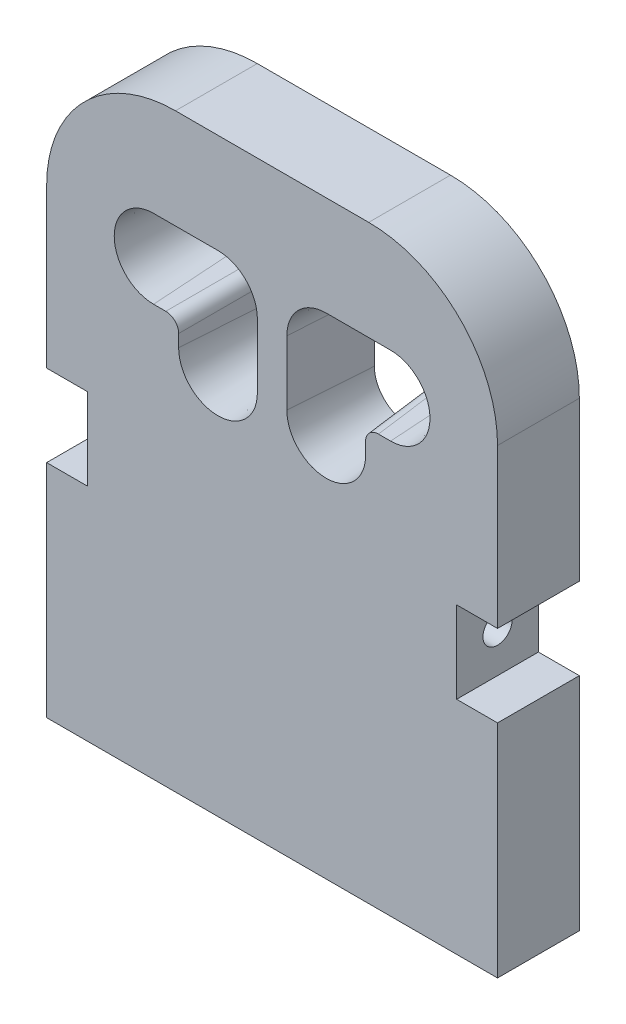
ISO-10303-21;
HEADER;
FILE_DESCRIPTION(('STEP AP214'),'2;1');
FILE_NAME('part.step','',(''),(''),'','','');
FILE_SCHEMA(('AUTOMOTIVE_DESIGN { 1 0 10303 214 1 1 1 1 }'));
ENDSEC;
DATA;
#1=APPLICATION_CONTEXT('core data for automotive mechanical design processes');
#2=APPLICATION_PROTOCOL_DEFINITION('international standard','automotive_design',2000,#1);
#3=PRODUCT_CONTEXT('',#1,'mechanical');
#4=PRODUCT('Part','Part','',(#3));
#5=PRODUCT_RELATED_PRODUCT_CATEGORY('part','',(#4));
#6=PRODUCT_DEFINITION_FORMATION('','',#4);
#7=PRODUCT_DEFINITION_CONTEXT('part definition',#1,'design');
#8=PRODUCT_DEFINITION('design','',#6,#7);
#9=PRODUCT_DEFINITION_SHAPE('','',#8);
#10=(LENGTH_UNIT() NAMED_UNIT(*) SI_UNIT(.MILLI.,.METRE.));
#11=(NAMED_UNIT(*) PLANE_ANGLE_UNIT() SI_UNIT($,.RADIAN.));
#12=(NAMED_UNIT(*) SI_UNIT($,.STERADIAN.) SOLID_ANGLE_UNIT());
#13=UNCERTAINTY_MEASURE_WITH_UNIT(LENGTH_MEASURE(1.E-05),#10,'distance_accuracy_value','');
#14=(GEOMETRIC_REPRESENTATION_CONTEXT(3) GLOBAL_UNCERTAINTY_ASSIGNED_CONTEXT((#13)) GLOBAL_UNIT_ASSIGNED_CONTEXT((#10,
#11,#12)) REPRESENTATION_CONTEXT('',''));
#15=CARTESIAN_POINT('',(0.,0.,0.));
#16=DIRECTION('',(0.,0.,1.));
#17=DIRECTION('',(1.,0.,0.));
#18=AXIS2_PLACEMENT_3D('',#15,#16,#17);
#19=CARTESIAN_POINT('',(0.,0.,6.35));
#20=DIRECTION('',(0.,0.,1.));
#21=DIRECTION('',(1.,0.,0.));
#22=AXIS2_PLACEMENT_3D('',#19,#20,#21);
#23=PLANE('',#22);
#24=DIRECTION('',(1.,0.,0.));
#25=VECTOR('',#24,1.);
#26=CARTESIAN_POINT('',(14.325,0.6,6.35));
#27=LINE('',#26,#25);
#28=CARTESIAN_POINT('',(14.325,0.6,6.35));
#29=VERTEX_POINT('',#28);
#30=CARTESIAN_POINT('',(17.5,0.6,6.35));
#31=VERTEX_POINT('',#30);
#32=EDGE_CURVE('E426',#29,#31,#27,.T.);
#33=ORIENTED_EDGE('',*,*,#32,.T.);
#34=DIRECTION('',(0.,1.,0.));
#35=VECTOR('',#34,1.);
#36=CARTESIAN_POINT('',(17.5,-22.9,6.35));
#37=LINE('',#36,#35);
#38=CARTESIAN_POINT('',(17.5,12.9,6.35));
#39=VERTEX_POINT('',#38);
#40=EDGE_CURVE('E466',#31,#39,#37,.T.);
#41=ORIENTED_EDGE('',*,*,#40,.T.);
#42=CARTESIAN_POINT('',(7.5,12.9,6.35));
#43=DIRECTION('',(0.,0.,1.));
#44=DIRECTION('',(1.,0.,0.));
#45=AXIS2_PLACEMENT_3D('',#42,#43,#44);
#46=CIRCLE('',#45,10.);
#47=CARTESIAN_POINT('',(7.5,22.9,6.35));
#48=VERTEX_POINT('',#47);
#49=EDGE_CURVE('E506',#39,#48,#46,.T.);
#50=ORIENTED_EDGE('',*,*,#49,.T.);
#51=DIRECTION('',(-1.,0.,0.));
#52=VECTOR('',#51,1.);
#53=CARTESIAN_POINT('',(17.5,22.9,6.35));
#54=LINE('',#53,#52);
#55=CARTESIAN_POINT('',(-7.50000000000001,22.9,6.35));
#56=VERTEX_POINT('',#55);
#57=EDGE_CURVE('E470',#48,#56,#54,.T.);
#58=ORIENTED_EDGE('',*,*,#57,.T.);
#59=CARTESIAN_POINT('',(-7.50000000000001,12.9,6.35));
#60=DIRECTION('',(0.,0.,1.));
#61=DIRECTION('',(1.,0.,0.));
#62=AXIS2_PLACEMENT_3D('',#59,#60,#61);
#63=CIRCLE('',#62,10.);
#64=CARTESIAN_POINT('',(-17.5,12.9,6.35));
#65=VERTEX_POINT('',#64);
#66=EDGE_CURVE('E504',#56,#65,#63,.T.);
#67=ORIENTED_EDGE('',*,*,#66,.T.);
#68=DIRECTION('',(0.,-1.,0.));
#69=VECTOR('',#68,1.);
#70=CARTESIAN_POINT('',(-17.5,-22.9,6.35));
#71=LINE('',#70,#69);
#72=CARTESIAN_POINT('',(-17.5,0.6,6.35));
#73=VERTEX_POINT('',#72);
#74=EDGE_CURVE('E460',#65,#73,#71,.T.);
#75=ORIENTED_EDGE('',*,*,#74,.T.);
#76=DIRECTION('',(-1.,0.,0.));
#77=VECTOR('',#76,1.);
#78=CARTESIAN_POINT('',(-14.325,0.6,6.35));
#79=LINE('',#78,#77);
#80=CARTESIAN_POINT('',(-14.325,0.6,6.35));
#81=VERTEX_POINT('',#80);
#82=EDGE_CURVE('E447',#81,#73,#79,.T.);
#83=ORIENTED_EDGE('',*,*,#82,.F.);
#84=DIRECTION('',(0.,1.,0.));
#85=VECTOR('',#84,1.);
#86=CARTESIAN_POINT('',(-14.325,0.6,6.35));
#87=LINE('',#86,#85);
#88=CARTESIAN_POINT('',(-14.325,-5.75,6.35));
#89=VERTEX_POINT('',#88);
#90=EDGE_CURVE('E436',#89,#81,#87,.T.);
#91=ORIENTED_EDGE('',*,*,#90,.F.);
#92=DIRECTION('',(-1.,0.,0.));
#93=VECTOR('',#92,1.);
#94=CARTESIAN_POINT('',(-14.325,-5.75,6.35));
#95=LINE('',#94,#93);
#96=CARTESIAN_POINT('',(-17.5,-5.75,6.35));
#97=VERTEX_POINT('',#96);
#98=EDGE_CURVE('E450',#89,#97,#95,.T.);
#99=ORIENTED_EDGE('',*,*,#98,.T.);
#100=CARTESIAN_POINT('',(-17.5,-22.9,6.35));
#101=VERTEX_POINT('',#100);
#102=EDGE_CURVE('E464',#97,#101,#71,.T.);
#103=ORIENTED_EDGE('',*,*,#102,.T.);
#104=DIRECTION('',(1.,0.,0.));
#105=VECTOR('',#104,1.);
#106=CARTESIAN_POINT('',(17.5,-22.9,6.35));
#107=LINE('',#106,#105);
#108=CARTESIAN_POINT('',(17.5,-22.9,6.35));
#109=VERTEX_POINT('',#108);
#110=EDGE_CURVE('E463',#101,#109,#107,.T.);
#111=ORIENTED_EDGE('',*,*,#110,.T.);
#112=CARTESIAN_POINT('',(17.5,-5.75,6.35));
#113=VERTEX_POINT('',#112);
#114=EDGE_CURVE('E467',#109,#113,#37,.T.);
#115=ORIENTED_EDGE('',*,*,#114,.T.);
#116=DIRECTION('',(1.,0.,0.));
#117=VECTOR('',#116,1.);
#118=CARTESIAN_POINT('',(14.325,-5.75,6.35));
#119=LINE('',#118,#117);
#120=CARTESIAN_POINT('',(14.325,-5.75,6.35));
#121=VERTEX_POINT('',#120);
#122=EDGE_CURVE('E423',#121,#113,#119,.T.);
#123=ORIENTED_EDGE('',*,*,#122,.F.);
#124=DIRECTION('',(0.,-1.,0.));
#125=VECTOR('',#124,1.);
#126=CARTESIAN_POINT('',(14.325,0.6,6.35));
#127=LINE('',#126,#125);
#128=EDGE_CURVE('E412',#29,#121,#127,.T.);
#129=ORIENTED_EDGE('',*,*,#128,.F.);
#130=EDGE_LOOP('',(#33,#41,#50,#58,#67,#75,#83,#91,#99,#103,#111,#115,#123,#129));
#131=FACE_BOUND('',#130,.T.);
#132=DIRECTION('',(0.,1.,0.));
#133=VECTOR('',#132,1.);
#134=CARTESIAN_POINT('',(-7.25502825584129,0.,6.35));
#135=LINE('',#134,#133);
#136=CARTESIAN_POINT('',(-7.25502825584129,7.1,6.35));
#137=VERTEX_POINT('',#136);
#138=CARTESIAN_POINT('',(-7.25502825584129,8.04740769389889,6.35));
#139=VERTEX_POINT('',#138);
#140=EDGE_CURVE('E344',#137,#139,#135,.T.);
#141=ORIENTED_EDGE('',*,*,#140,.T.);
#142=CARTESIAN_POINT('',(-8.25747015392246,8.04252984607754,6.35));
#143=DIRECTION('',(0.,0.,1.));
#144=DIRECTION('',(0.707106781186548,0.707106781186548,0.));
#145=AXIS2_PLACEMENT_3D('',#142,#143,#144);
#146=ELLIPSE('',#145,1.00487786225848,1.);
#147=CARTESIAN_POINT('',(-8.25259230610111,9.04497174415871,6.35));
#148=VERTEX_POINT('',#147);
#149=EDGE_CURVE('E518',#139,#148,#146,.T.);
#150=ORIENTED_EDGE('',*,*,#149,.T.);
#151=DIRECTION('',(-1.,0.,0.));
#152=VECTOR('',#151,1.);
#153=CARTESIAN_POINT('',(0.,9.04497174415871,6.35));
#154=LINE('',#153,#152);
#155=CARTESIAN_POINT('',(-9.2,9.04497174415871,6.35));
#156=VERTEX_POINT('',#155);
#157=EDGE_CURVE('E347',#148,#156,#154,.T.);
#158=ORIENTED_EDGE('',*,*,#157,.T.);
#159=CARTESIAN_POINT('',(-9.2,12.1,6.35));
#160=DIRECTION('',(0.,0.,-1.));
#161=DIRECTION('',(-1.,0.,0.));
#162=AXIS2_PLACEMENT_3D('',#159,#160,#161);
#163=CIRCLE('',#162,3.05502825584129);
#164=CARTESIAN_POINT('',(-9.2,15.1550282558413,6.35));
#165=VERTEX_POINT('',#164);
#166=EDGE_CURVE('E359',#156,#165,#163,.T.);
#167=ORIENTED_EDGE('',*,*,#166,.T.);
#168=DIRECTION('',(1.,0.,0.));
#169=VECTOR('',#168,1.);
#170=CARTESIAN_POINT('',(0.,15.1550282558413,6.35));
#171=LINE('',#170,#169);
#172=CARTESIAN_POINT('',(-4.2,15.1550282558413,6.35));
#173=VERTEX_POINT('',#172);
#174=EDGE_CURVE('E357',#173,#165,#171,.F.);
#175=ORIENTED_EDGE('',*,*,#174,.F.);
#176=CARTESIAN_POINT('',(-4.2,12.1,6.35));
#177=DIRECTION('',(0.,0.,-1.));
#178=DIRECTION('',(-1.,0.,0.));
#179=AXIS2_PLACEMENT_3D('',#176,#177,#178);
#180=CIRCLE('',#179,3.05502825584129);
#181=CARTESIAN_POINT('',(-1.14497174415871,12.1,6.35));
#182=VERTEX_POINT('',#181);
#183=EDGE_CURVE('E354',#173,#182,#180,.T.);
#184=ORIENTED_EDGE('',*,*,#183,.T.);
#185=DIRECTION('',(0.,-1.,0.));
#186=VECTOR('',#185,1.);
#187=CARTESIAN_POINT('',(-1.14497174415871,0.,6.35));
#188=LINE('',#187,#186);
#189=CARTESIAN_POINT('',(-1.14497174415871,7.10000000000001,6.35));
#190=VERTEX_POINT('',#189);
#191=EDGE_CURVE('E352',#190,#182,#188,.F.);
#192=ORIENTED_EDGE('',*,*,#191,.F.);
#193=CARTESIAN_POINT('',(-4.2,7.1,6.35));
#194=DIRECTION('',(0.,0.,-1.));
#195=DIRECTION('',(-1.,0.,0.));
#196=AXIS2_PLACEMENT_3D('',#193,#194,#195);
#197=CIRCLE('',#196,3.05502825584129);
#198=EDGE_CURVE('E348',#190,#137,#197,.T.);
#199=ORIENTED_EDGE('',*,*,#198,.T.);
#200=EDGE_LOOP('',(#141,#150,#158,#167,#175,#184,#192,#199));
#201=FACE_BOUND('',#200,.T.);
#202=DIRECTION('',(-1.,0.,0.));
#203=VECTOR('',#202,1.);
#204=CARTESIAN_POINT('',(0.,9.04497174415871,6.35));
#205=LINE('',#204,#203);
#206=CARTESIAN_POINT('',(8.25259230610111,9.04497174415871,6.35));
#207=VERTEX_POINT('',#206);
#208=CARTESIAN_POINT('',(9.2,9.04497174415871,6.35));
#209=VERTEX_POINT('',#208);
#210=EDGE_CURVE('E297',#207,#209,#205,.F.);
#211=ORIENTED_EDGE('',*,*,#210,.F.);
#212=CARTESIAN_POINT('',(8.25747015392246,8.04252984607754,6.35));
#213=DIRECTION('',(0.,0.,1.));
#214=DIRECTION('',(-0.707106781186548,0.707106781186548,0.));
#215=AXIS2_PLACEMENT_3D('',#212,#213,#214);
#216=ELLIPSE('',#215,1.00487786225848,1.);
#217=CARTESIAN_POINT('',(7.25502825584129,8.04740769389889,6.35));
#218=VERTEX_POINT('',#217);
#219=EDGE_CURVE('E13',#207,#218,#216,.T.);
#220=ORIENTED_EDGE('',*,*,#219,.T.);
#221=DIRECTION('',(0.,-1.,0.));
#222=VECTOR('',#221,1.);
#223=CARTESIAN_POINT('',(7.25502825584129,0.,6.35));
#224=LINE('',#223,#222);
#225=CARTESIAN_POINT('',(7.25502825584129,7.10000000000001,6.35));
#226=VERTEX_POINT('',#225);
#227=EDGE_CURVE('E293',#226,#218,#224,.F.);
#228=ORIENTED_EDGE('',*,*,#227,.F.);
#229=CARTESIAN_POINT('',(4.2,7.1,6.35));
#230=DIRECTION('',(0.,0.,-1.));
#231=DIRECTION('',(-1.,0.,0.));
#232=AXIS2_PLACEMENT_3D('',#229,#230,#231);
#233=CIRCLE('',#232,3.05502825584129);
#234=CARTESIAN_POINT('',(1.14497174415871,7.1,6.35));
#235=VERTEX_POINT('',#234);
#236=EDGE_CURVE('E296',#235,#226,#233,.F.);
#237=ORIENTED_EDGE('',*,*,#236,.F.);
#238=DIRECTION('',(0.,1.,0.));
#239=VECTOR('',#238,1.);
#240=CARTESIAN_POINT('',(1.14497174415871,0.,6.35));
#241=LINE('',#240,#239);
#242=CARTESIAN_POINT('',(1.14497174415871,12.1,6.35));
#243=VERTEX_POINT('',#242);
#244=EDGE_CURVE('E307',#235,#243,#241,.T.);
#245=ORIENTED_EDGE('',*,*,#244,.T.);
#246=CARTESIAN_POINT('',(4.2,12.1,6.35));
#247=DIRECTION('',(0.,0.,-1.));
#248=DIRECTION('',(-1.,0.,0.));
#249=AXIS2_PLACEMENT_3D('',#246,#247,#248);
#250=CIRCLE('',#249,3.05502825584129);
#251=CARTESIAN_POINT('',(4.2,15.1550282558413,6.35));
#252=VERTEX_POINT('',#251);
#253=EDGE_CURVE('E305',#252,#243,#250,.F.);
#254=ORIENTED_EDGE('',*,*,#253,.F.);
#255=DIRECTION('',(1.,0.,0.));
#256=VECTOR('',#255,1.);
#257=CARTESIAN_POINT('',(0.,15.1550282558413,6.35));
#258=LINE('',#257,#256);
#259=CARTESIAN_POINT('',(9.2,15.1550282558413,6.35));
#260=VERTEX_POINT('',#259);
#261=EDGE_CURVE('E302',#252,#260,#258,.T.);
#262=ORIENTED_EDGE('',*,*,#261,.T.);
#263=CARTESIAN_POINT('',(9.2,12.1,6.35));
#264=DIRECTION('',(0.,0.,-1.));
#265=DIRECTION('',(-1.,0.,0.));
#266=AXIS2_PLACEMENT_3D('',#263,#264,#265);
#267=CIRCLE('',#266,3.05502825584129);
#268=EDGE_CURVE('E300',#209,#260,#267,.F.);
#269=ORIENTED_EDGE('',*,*,#268,.F.);
#270=EDGE_LOOP('',(#211,#220,#228,#237,#245,#254,#262,#269));
#271=FACE_BOUND('',#270,.T.);
#272=ADVANCED_FACE('F46',(#131,#201,#271),#23,.T.);
#273=CARTESIAN_POINT('',(0.,0.,0.));
#274=DIRECTION('',(0.,0.,1.));
#275=DIRECTION('',(1.,0.,0.));
#276=AXIS2_PLACEMENT_3D('',#273,#274,#275);
#277=PLANE('',#276);
#278=CARTESIAN_POINT('',(0.,2.1,0.));
#279=DIRECTION('',(0.,0.,-1.));
#280=DIRECTION('',(-1.,0.,0.));
#281=AXIS2_PLACEMENT_3D('',#278,#279,#280);
#282=CIRCLE('',#281,1.13029999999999);
#283=CARTESIAN_POINT('',(-1.13029999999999,2.1,0.));
#284=VERTEX_POINT('',#283);
#285=EDGE_CURVE('E270',#284,#284,#282,.T.);
#286=ORIENTED_EDGE('',*,*,#285,.F.);
#287=EDGE_LOOP('',(#286));
#288=FACE_BOUND('',#287,.T.);
#289=DIRECTION('',(0.,1.,0.));
#290=VECTOR('',#289,1.);
#291=CARTESIAN_POINT('',(17.5,-22.9,0.));
#292=LINE('',#291,#290);
#293=CARTESIAN_POINT('',(17.5,0.6,0.));
#294=VERTEX_POINT('',#293);
#295=CARTESIAN_POINT('',(17.5,12.9,0.));
#296=VERTEX_POINT('',#295);
#297=EDGE_CURVE('E479',#294,#296,#292,.T.);
#298=ORIENTED_EDGE('',*,*,#297,.F.);
#299=DIRECTION('',(1.,0.,0.));
#300=VECTOR('',#299,1.);
#301=CARTESIAN_POINT('',(14.325,0.6,0.));
#302=LINE('',#301,#300);
#303=CARTESIAN_POINT('',(14.325,0.6,0.));
#304=VERTEX_POINT('',#303);
#305=EDGE_CURVE('E430',#304,#294,#302,.T.);
#306=ORIENTED_EDGE('',*,*,#305,.F.);
#307=DIRECTION('',(0.,1.,0.));
#308=VECTOR('',#307,1.);
#309=CARTESIAN_POINT('',(14.325,0.6,0.));
#310=LINE('',#309,#308);
#311=CARTESIAN_POINT('',(14.325,-5.75,0.));
#312=VERTEX_POINT('',#311);
#313=EDGE_CURVE('E418',#312,#304,#310,.T.);
#314=ORIENTED_EDGE('',*,*,#313,.F.);
#315=DIRECTION('',(1.,0.,0.));
#316=VECTOR('',#315,1.);
#317=CARTESIAN_POINT('',(14.325,-5.75,0.));
#318=LINE('',#317,#316);
#319=CARTESIAN_POINT('',(17.5,-5.75,0.));
#320=VERTEX_POINT('',#319);
#321=EDGE_CURVE('E432',#312,#320,#318,.T.);
#322=ORIENTED_EDGE('',*,*,#321,.T.);
#323=CARTESIAN_POINT('',(17.5,-22.9,0.));
#324=VERTEX_POINT('',#323);
#325=EDGE_CURVE('E480',#324,#320,#292,.T.);
#326=ORIENTED_EDGE('',*,*,#325,.F.);
#327=DIRECTION('',(1.,0.,0.));
#328=VECTOR('',#327,1.);
#329=CARTESIAN_POINT('',(17.5,-22.9,0.));
#330=LINE('',#329,#328);
#331=CARTESIAN_POINT('',(-17.5,-22.9,0.));
#332=VERTEX_POINT('',#331);
#333=EDGE_CURVE('E477',#332,#324,#330,.T.);
#334=ORIENTED_EDGE('',*,*,#333,.F.);
#335=DIRECTION('',(0.,-1.,0.));
#336=VECTOR('',#335,1.);
#337=CARTESIAN_POINT('',(-17.5,-22.9,0.));
#338=LINE('',#337,#336);
#339=CARTESIAN_POINT('',(-17.5,-5.75,0.));
#340=VERTEX_POINT('',#339);
#341=EDGE_CURVE('E453',#340,#332,#338,.T.);
#342=ORIENTED_EDGE('',*,*,#341,.F.);
#343=DIRECTION('',(-1.,0.,0.));
#344=VECTOR('',#343,1.);
#345=CARTESIAN_POINT('',(-14.325,-5.75,0.));
#346=LINE('',#345,#344);
#347=CARTESIAN_POINT('',(-14.325,-5.75,0.));
#348=VERTEX_POINT('',#347);
#349=EDGE_CURVE('E454',#348,#340,#346,.T.);
#350=ORIENTED_EDGE('',*,*,#349,.F.);
#351=DIRECTION('',(0.,-1.,0.));
#352=VECTOR('',#351,1.);
#353=CARTESIAN_POINT('',(-14.325,0.599999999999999,0.));
#354=LINE('',#353,#352);
#355=CARTESIAN_POINT('',(-14.325,0.6,0.));
#356=VERTEX_POINT('',#355);
#357=EDGE_CURVE('E442',#356,#348,#354,.T.);
#358=ORIENTED_EDGE('',*,*,#357,.F.);
#359=DIRECTION('',(-1.,0.,0.));
#360=VECTOR('',#359,1.);
#361=CARTESIAN_POINT('',(-14.325,0.599999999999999,0.));
#362=LINE('',#361,#360);
#363=CARTESIAN_POINT('',(-17.5,0.599999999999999,0.));
#364=VERTEX_POINT('',#363);
#365=EDGE_CURVE('E456',#356,#364,#362,.T.);
#366=ORIENTED_EDGE('',*,*,#365,.T.);
#367=CARTESIAN_POINT('',(-17.5,12.9,0.));
#368=VERTEX_POINT('',#367);
#369=EDGE_CURVE('E474',#368,#364,#338,.T.);
#370=ORIENTED_EDGE('',*,*,#369,.F.);
#371=CARTESIAN_POINT('',(-7.50000000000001,12.9,0.));
#372=DIRECTION('',(0.,0.,1.));
#373=DIRECTION('',(1.,0.,0.));
#374=AXIS2_PLACEMENT_3D('',#371,#372,#373);
#375=CIRCLE('',#374,10.);
#376=CARTESIAN_POINT('',(-7.50000000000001,22.9,0.));
#377=VERTEX_POINT('',#376);
#378=EDGE_CURVE('E496',#368,#377,#375,.F.);
#379=ORIENTED_EDGE('',*,*,#378,.T.);
#380=DIRECTION('',(-1.,0.,0.));
#381=VECTOR('',#380,1.);
#382=CARTESIAN_POINT('',(17.5,22.9,0.));
#383=LINE('',#382,#381);
#384=CARTESIAN_POINT('',(7.5,22.9,0.));
#385=VERTEX_POINT('',#384);
#386=EDGE_CURVE('E483',#385,#377,#383,.T.);
#387=ORIENTED_EDGE('',*,*,#386,.F.);
#388=CARTESIAN_POINT('',(7.5,12.9,0.));
#389=DIRECTION('',(0.,0.,1.));
#390=DIRECTION('',(1.,0.,0.));
#391=AXIS2_PLACEMENT_3D('',#388,#389,#390);
#392=CIRCLE('',#391,10.);
#393=EDGE_CURVE('E498',#385,#296,#392,.F.);
#394=ORIENTED_EDGE('',*,*,#393,.T.);
#395=EDGE_LOOP('',(#298,#306,#314,#322,#326,#334,#342,#350,#358,#366,#370,#379,#387,#394));
#396=FACE_BOUND('',#395,.T.);
#397=DIRECTION('',(-1.,0.,0.));
#398=VECTOR('',#397,1.);
#399=CARTESIAN_POINT('',(0.,9.489007,0.));
#400=LINE('',#399,#398);
#401=CARTESIAN_POINT('',(-7.80855705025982,9.489007,0.));
#402=VERTEX_POINT('',#401);
#403=CARTESIAN_POINT('',(-9.2,9.489007,0.));
#404=VERTEX_POINT('',#403);
#405=EDGE_CURVE('E327',#402,#404,#400,.T.);
#406=ORIENTED_EDGE('',*,*,#405,.F.);
#407=CARTESIAN_POINT('',(-7.81343489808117,8.48656510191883,0.));
#408=DIRECTION('',(0.,0.,1.));
#409=DIRECTION('',(0.707106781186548,0.707106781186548,0.));
#410=AXIS2_PLACEMENT_3D('',#407,#408,#409);
#411=ELLIPSE('',#410,1.00487786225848,1.);
#412=CARTESIAN_POINT('',(-6.810993,8.49144294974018,0.));
#413=VERTEX_POINT('',#412);
#414=EDGE_CURVE('E514',#402,#413,#411,.F.);
#415=ORIENTED_EDGE('',*,*,#414,.T.);
#416=DIRECTION('',(0.,1.,0.));
#417=VECTOR('',#416,1.);
#418=CARTESIAN_POINT('',(-6.810993,0.,0.));
#419=LINE('',#418,#417);
#420=CARTESIAN_POINT('',(-6.810993,7.1,0.));
#421=VERTEX_POINT('',#420);
#422=EDGE_CURVE('E324',#421,#413,#419,.T.);
#423=ORIENTED_EDGE('',*,*,#422,.F.);
#424=CARTESIAN_POINT('',(-4.2,7.1,0.));
#425=DIRECTION('',(0.,0.,-1.));
#426=DIRECTION('',(-1.,0.,0.));
#427=AXIS2_PLACEMENT_3D('',#424,#425,#426);
#428=CIRCLE('',#427,2.610993);
#429=CARTESIAN_POINT('',(-1.589007,7.1,0.));
#430=VERTEX_POINT('',#429);
#431=EDGE_CURVE('E341',#430,#421,#428,.T.);
#432=ORIENTED_EDGE('',*,*,#431,.F.);
#433=DIRECTION('',(0.,1.,0.));
#434=VECTOR('',#433,1.);
#435=CARTESIAN_POINT('',(-1.589007,0.,0.));
#436=LINE('',#435,#434);
#437=CARTESIAN_POINT('',(-1.589007,12.1,0.));
#438=VERTEX_POINT('',#437);
#439=EDGE_CURVE('E338',#430,#438,#436,.T.);
#440=ORIENTED_EDGE('',*,*,#439,.T.);
#441=CARTESIAN_POINT('',(-4.2,12.1,0.));
#442=DIRECTION('',(0.,0.,-1.));
#443=DIRECTION('',(-1.,0.,0.));
#444=AXIS2_PLACEMENT_3D('',#441,#442,#443);
#445=CIRCLE('',#444,2.610993);
#446=CARTESIAN_POINT('',(-4.2,14.710993,0.));
#447=VERTEX_POINT('',#446);
#448=EDGE_CURVE('E335',#447,#438,#445,.T.);
#449=ORIENTED_EDGE('',*,*,#448,.F.);
#450=DIRECTION('',(-1.,0.,0.));
#451=VECTOR('',#450,1.);
#452=CARTESIAN_POINT('',(0.,14.710993,0.));
#453=LINE('',#452,#451);
#454=CARTESIAN_POINT('',(-9.2,14.710993,0.));
#455=VERTEX_POINT('',#454);
#456=EDGE_CURVE('E332',#447,#455,#453,.T.);
#457=ORIENTED_EDGE('',*,*,#456,.T.);
#458=CARTESIAN_POINT('',(-9.2,12.1,0.));
#459=DIRECTION('',(0.,0.,-1.));
#460=DIRECTION('',(-1.,0.,0.));
#461=AXIS2_PLACEMENT_3D('',#458,#459,#460);
#462=CIRCLE('',#461,2.610993);
#463=EDGE_CURVE('E329',#404,#455,#462,.T.);
#464=ORIENTED_EDGE('',*,*,#463,.F.);
#465=EDGE_LOOP('',(#406,#415,#423,#432,#440,#449,#457,#464));
#466=FACE_BOUND('',#465,.T.);
#467=DIRECTION('',(0.,1.,0.));
#468=VECTOR('',#467,1.);
#469=CARTESIAN_POINT('',(6.810993,0.,0.));
#470=LINE('',#469,#468);
#471=CARTESIAN_POINT('',(6.810993,7.1,0.));
#472=VERTEX_POINT('',#471);
#473=CARTESIAN_POINT('',(6.810993,8.49144294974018,0.));
#474=VERTEX_POINT('',#473);
#475=EDGE_CURVE('E269',#472,#474,#470,.T.);
#476=ORIENTED_EDGE('',*,*,#475,.T.);
#477=CARTESIAN_POINT('',(7.81343489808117,8.48656510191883,0.));
#478=DIRECTION('',(0.,0.,1.));
#479=DIRECTION('',(-0.707106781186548,0.707106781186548,0.));
#480=AXIS2_PLACEMENT_3D('',#477,#478,#479);
#481=ELLIPSE('',#480,1.00487786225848,1.);
#482=CARTESIAN_POINT('',(7.80855705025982,9.489007,0.));
#483=VERTEX_POINT('',#482);
#484=EDGE_CURVE('E68',#474,#483,#481,.F.);
#485=ORIENTED_EDGE('',*,*,#484,.T.);
#486=DIRECTION('',(1.,0.,0.));
#487=VECTOR('',#486,1.);
#488=CARTESIAN_POINT('',(0.,9.489007,0.));
#489=LINE('',#488,#487);
#490=CARTESIAN_POINT('',(9.2,9.489007,0.));
#491=VERTEX_POINT('',#490);
#492=EDGE_CURVE('E291',#483,#491,#489,.T.);
#493=ORIENTED_EDGE('',*,*,#492,.T.);
#494=CARTESIAN_POINT('',(9.2,12.1,0.));
#495=DIRECTION('',(0.,0.,1.));
#496=DIRECTION('',(1.,0.,0.));
#497=AXIS2_PLACEMENT_3D('',#494,#495,#496);
#498=CIRCLE('',#497,2.610993);
#499=CARTESIAN_POINT('',(9.2,14.710993,0.));
#500=VERTEX_POINT('',#499);
#501=EDGE_CURVE('E288',#491,#500,#498,.T.);
#502=ORIENTED_EDGE('',*,*,#501,.T.);
#503=DIRECTION('',(1.,0.,0.));
#504=VECTOR('',#503,1.);
#505=CARTESIAN_POINT('',(0.,14.710993,0.));
#506=LINE('',#505,#504);
#507=CARTESIAN_POINT('',(4.2,14.710993,0.));
#508=VERTEX_POINT('',#507);
#509=EDGE_CURVE('E285',#508,#500,#506,.T.);
#510=ORIENTED_EDGE('',*,*,#509,.F.);
#511=CARTESIAN_POINT('',(4.2,12.1,0.));
#512=DIRECTION('',(0.,0.,1.));
#513=DIRECTION('',(1.,0.,0.));
#514=AXIS2_PLACEMENT_3D('',#511,#512,#513);
#515=CIRCLE('',#514,2.610993);
#516=CARTESIAN_POINT('',(1.589007,12.1,0.));
#517=VERTEX_POINT('',#516);
#518=EDGE_CURVE('E282',#508,#517,#515,.T.);
#519=ORIENTED_EDGE('',*,*,#518,.T.);
#520=DIRECTION('',(0.,1.,0.));
#521=VECTOR('',#520,1.);
#522=CARTESIAN_POINT('',(1.589007,0.,0.));
#523=LINE('',#522,#521);
#524=CARTESIAN_POINT('',(1.589007,7.1,0.));
#525=VERTEX_POINT('',#524);
#526=EDGE_CURVE('E279',#525,#517,#523,.T.);
#527=ORIENTED_EDGE('',*,*,#526,.F.);
#528=CARTESIAN_POINT('',(4.2,7.1,0.));
#529=DIRECTION('',(0.,0.,1.));
#530=DIRECTION('',(1.,0.,0.));
#531=AXIS2_PLACEMENT_3D('',#528,#529,#530);
#532=CIRCLE('',#531,2.610993);
#533=EDGE_CURVE('E272',#525,#472,#532,.T.);
#534=ORIENTED_EDGE('',*,*,#533,.T.);
#535=EDGE_LOOP('',(#476,#485,#493,#502,#510,#519,#527,#534));
#536=FACE_BOUND('',#535,.T.);
#537=ADVANCED_FACE('F530',(#288,#396,#466,#536),#277,.F.);
#538=CARTESIAN_POINT('',(17.5,-22.9,6.35));
#539=DIRECTION('',(-1.,0.,0.));
#540=DIRECTION('',(0.,0.,1.));
#541=AXIS2_PLACEMENT_3D('',#538,#539,#540);
#542=PLANE('',#541);
#543=ORIENTED_EDGE('',*,*,#40,.F.);
#544=DIRECTION('',(0.,0.,1.));
#545=VECTOR('',#544,1.);
#546=CARTESIAN_POINT('',(17.5,0.6,6.35));
#547=LINE('',#546,#545);
#548=EDGE_CURVE('E416',#294,#31,#547,.T.);
#549=ORIENTED_EDGE('',*,*,#548,.F.);
#550=ORIENTED_EDGE('',*,*,#297,.T.);
#551=DIRECTION('',(0.,0.,-1.));
#552=VECTOR('',#551,1.);
#553=CARTESIAN_POINT('',(17.5,12.9,6.35));
#554=LINE('',#553,#552);
#555=EDGE_CURVE('E501',#296,#39,#554,.F.);
#556=ORIENTED_EDGE('',*,*,#555,.T.);
#557=EDGE_LOOP('',(#543,#549,#550,#556));
#558=FACE_BOUND('',#557,.T.);
#559=ADVANCED_FACE('F551',(#558),#542,.F.);
#560=CARTESIAN_POINT('',(-17.5,-22.9,6.35));
#561=DIRECTION('',(1.,0.,0.));
#562=DIRECTION('',(0.,0.,-1.));
#563=AXIS2_PLACEMENT_3D('',#560,#561,#562);
#564=PLANE('',#563);
#565=ORIENTED_EDGE('',*,*,#102,.F.);
#566=DIRECTION('',(0.,0.,1.));
#567=VECTOR('',#566,1.);
#568=CARTESIAN_POINT('',(-17.5,-5.75,6.35));
#569=LINE('',#568,#567);
#570=EDGE_CURVE('E440',#340,#97,#569,.T.);
#571=ORIENTED_EDGE('',*,*,#570,.F.);
#572=ORIENTED_EDGE('',*,*,#341,.T.);
#573=DIRECTION('',(0.,0.,-1.));
#574=VECTOR('',#573,1.);
#575=CARTESIAN_POINT('',(-17.5,-22.9,6.35));
#576=LINE('',#575,#574);
#577=EDGE_CURVE('E488',#101,#332,#576,.T.);
#578=ORIENTED_EDGE('',*,*,#577,.F.);
#579=EDGE_LOOP('',(#565,#571,#572,#578));
#580=FACE_BOUND('',#579,.T.);
#581=ADVANCED_FACE('F575',(#580),#564,.F.);
#582=ORIENTED_EDGE('',*,*,#369,.T.);
#583=DIRECTION('',(0.,0.,-1.));
#584=VECTOR('',#583,1.);
#585=CARTESIAN_POINT('',(-17.5,0.6,6.35));
#586=LINE('',#585,#584);
#587=EDGE_CURVE('E429',#73,#364,#586,.T.);
#588=ORIENTED_EDGE('',*,*,#587,.F.);
#589=ORIENTED_EDGE('',*,*,#74,.F.);
#590=DIRECTION('',(0.,0.,-1.));
#591=VECTOR('',#590,1.);
#592=CARTESIAN_POINT('',(-17.5,12.9,6.35));
#593=LINE('',#592,#591);
#594=EDGE_CURVE('E508',#65,#368,#593,.T.);
#595=ORIENTED_EDGE('',*,*,#594,.T.);
#596=EDGE_LOOP('',(#582,#588,#589,#595));
#597=FACE_BOUND('',#596,.T.);
#598=ADVANCED_FACE('F571',(#597),#564,.F.);
#599=CARTESIAN_POINT('',(17.5,-22.9,6.35));
#600=DIRECTION('',(0.,1.,0.));
#601=DIRECTION('',(0.,0.,1.));
#602=AXIS2_PLACEMENT_3D('',#599,#600,#601);
#603=PLANE('',#602);
#604=CARTESIAN_POINT('',(5.50000000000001,-22.9,3.175));
#605=DIRECTION('',(0.,-1.,0.));
#606=DIRECTION('',(0.,0.,-1.));
#607=AXIS2_PLACEMENT_3D('',#604,#605,#606);
#608=CIRCLE('',#607,1.58749999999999);
#609=CARTESIAN_POINT('',(5.50000000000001,-22.9,1.58750000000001));
#610=VERTEX_POINT('',#609);
#611=EDGE_CURVE('E365',#610,#610,#608,.T.);
#612=ORIENTED_EDGE('',*,*,#611,.F.);
#613=EDGE_LOOP('',(#612));
#614=FACE_BOUND('',#613,.T.);
#615=CARTESIAN_POINT('',(11.5,-22.9,3.175));
#616=DIRECTION('',(0.,-1.,0.));
#617=DIRECTION('',(0.,0.,-1.));
#618=AXIS2_PLACEMENT_3D('',#615,#616,#617);
#619=CIRCLE('',#618,1.1303);
#620=CARTESIAN_POINT('',(11.5,-22.9,2.0447));
#621=VERTEX_POINT('',#620);
#622=EDGE_CURVE('E381',#621,#621,#619,.T.);
#623=ORIENTED_EDGE('',*,*,#622,.F.);
#624=EDGE_LOOP('',(#623));
#625=FACE_BOUND('',#624,.T.);
#626=CARTESIAN_POINT('',(-11.5,-22.9,3.175));
#627=DIRECTION('',(0.,-1.,0.));
#628=DIRECTION('',(0.,0.,-1.));
#629=AXIS2_PLACEMENT_3D('',#626,#627,#628);
#630=CIRCLE('',#629,1.1303);
#631=CARTESIAN_POINT('',(-11.5,-22.9,2.0447));
#632=VERTEX_POINT('',#631);
#633=EDGE_CURVE('E387',#632,#632,#630,.T.);
#634=ORIENTED_EDGE('',*,*,#633,.F.);
#635=EDGE_LOOP('',(#634));
#636=FACE_BOUND('',#635,.T.);
#637=CARTESIAN_POINT('',(-5.50000000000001,-22.9,3.175));
#638=DIRECTION('',(0.,-1.,0.));
#639=DIRECTION('',(0.,0.,-1.));
#640=AXIS2_PLACEMENT_3D('',#637,#638,#639);
#641=CIRCLE('',#640,1.58749999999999);
#642=CARTESIAN_POINT('',(-5.50000000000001,-22.9,1.58750000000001));
#643=VERTEX_POINT('',#642);
#644=EDGE_CURVE('E393',#643,#643,#641,.T.);
#645=ORIENTED_EDGE('',*,*,#644,.F.);
#646=EDGE_LOOP('',(#645));
#647=FACE_BOUND('',#646,.T.);
#648=ORIENTED_EDGE('',*,*,#333,.T.);
#649=DIRECTION('',(0.,0.,-1.));
#650=VECTOR('',#649,1.);
#651=CARTESIAN_POINT('',(17.5,-22.9,6.35));
#652=LINE('',#651,#650);
#653=EDGE_CURVE('E473',#109,#324,#652,.T.);
#654=ORIENTED_EDGE('',*,*,#653,.F.);
#655=ORIENTED_EDGE('',*,*,#110,.F.);
#656=ORIENTED_EDGE('',*,*,#577,.T.);
#657=EDGE_LOOP('',(#648,#654,#655,#656));
#658=FACE_BOUND('',#657,.T.);
#659=ADVANCED_FACE('F567',(#614,#625,#636,#647,#658),#603,.F.);
#660=ORIENTED_EDGE('',*,*,#325,.T.);
#661=DIRECTION('',(0.,0.,-1.));
#662=VECTOR('',#661,1.);
#663=CARTESIAN_POINT('',(17.5,-5.75,6.35));
#664=LINE('',#663,#662);
#665=EDGE_CURVE('E411',#113,#320,#664,.T.);
#666=ORIENTED_EDGE('',*,*,#665,.F.);
#667=ORIENTED_EDGE('',*,*,#114,.F.);
#668=ORIENTED_EDGE('',*,*,#653,.T.);
#669=EDGE_LOOP('',(#660,#666,#667,#668));
#670=FACE_BOUND('',#669,.T.);
#671=ADVANCED_FACE('F563',(#670),#542,.F.);
#672=CARTESIAN_POINT('',(17.5,22.9,6.35));
#673=DIRECTION('',(0.,-1.,0.));
#674=DIRECTION('',(1.,0.,0.));
#675=AXIS2_PLACEMENT_3D('',#672,#673,#674);
#676=PLANE('',#675);
#677=ORIENTED_EDGE('',*,*,#57,.F.);
#678=DIRECTION('',(0.,0.,-1.));
#679=VECTOR('',#678,1.);
#680=CARTESIAN_POINT('',(7.5,22.9,6.35));
#681=LINE('',#680,#679);
#682=EDGE_CURVE('E493',#48,#385,#681,.T.);
#683=ORIENTED_EDGE('',*,*,#682,.T.);
#684=ORIENTED_EDGE('',*,*,#386,.T.);
#685=DIRECTION('',(0.,0.,-1.));
#686=VECTOR('',#685,1.);
#687=CARTESIAN_POINT('',(-7.50000000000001,22.9,6.35));
#688=LINE('',#687,#686);
#689=EDGE_CURVE('E491',#377,#56,#688,.F.);
#690=ORIENTED_EDGE('',*,*,#689,.T.);
#691=EDGE_LOOP('',(#677,#683,#684,#690));
#692=FACE_BOUND('',#691,.T.);
#693=ADVANCED_FACE('F559',(#692),#676,.F.);
#694=CARTESIAN_POINT('',(7.5,12.9,6.35));
#695=DIRECTION('',(0.,0.,-1.));
#696=DIRECTION('',(-1.,0.,0.));
#697=AXIS2_PLACEMENT_3D('',#694,#695,#696);
#698=CYLINDRICAL_SURFACE('',#697,10.);
#699=ORIENTED_EDGE('',*,*,#49,.F.);
#700=ORIENTED_EDGE('',*,*,#555,.F.);
#701=ORIENTED_EDGE('',*,*,#393,.F.);
#702=ORIENTED_EDGE('',*,*,#682,.F.);
#703=EDGE_LOOP('',(#699,#700,#701,#702));
#704=FACE_BOUND('',#703,.T.);
#705=ADVANCED_FACE('F562',(#704),#698,.T.);
#706=CARTESIAN_POINT('',(-7.50000000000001,12.9,6.35));
#707=DIRECTION('',(0.,0.,-1.));
#708=DIRECTION('',(-1.,0.,0.));
#709=AXIS2_PLACEMENT_3D('',#706,#707,#708);
#710=CYLINDRICAL_SURFACE('',#709,10.);
#711=ORIENTED_EDGE('',*,*,#66,.F.);
#712=ORIENTED_EDGE('',*,*,#689,.F.);
#713=ORIENTED_EDGE('',*,*,#378,.F.);
#714=ORIENTED_EDGE('',*,*,#594,.F.);
#715=EDGE_LOOP('',(#711,#712,#713,#714));
#716=FACE_BOUND('',#715,.T.);
#717=ADVANCED_FACE('F579',(#716),#710,.T.);
#718=CARTESIAN_POINT('',(-14.325,-5.75,6.35));
#719=DIRECTION('',(0.,-1.,0.));
#720=DIRECTION('',(0.,0.,-1.));
#721=AXIS2_PLACEMENT_3D('',#718,#719,#720);
#722=PLANE('',#721);
#723=ORIENTED_EDGE('',*,*,#570,.T.);
#724=ORIENTED_EDGE('',*,*,#98,.F.);
#725=DIRECTION('',(0.,0.,1.));
#726=VECTOR('',#725,1.);
#727=CARTESIAN_POINT('',(-14.325,-5.75,6.35));
#728=LINE('',#727,#726);
#729=EDGE_CURVE('E444',#348,#89,#728,.T.);
#730=ORIENTED_EDGE('',*,*,#729,.F.);
#731=ORIENTED_EDGE('',*,*,#349,.T.);
#732=EDGE_LOOP('',(#723,#724,#730,#731));
#733=FACE_BOUND('',#732,.T.);
#734=ADVANCED_FACE('F582',(#733),#722,.F.);
#735=CARTESIAN_POINT('',(-14.325,0.6,6.35));
#736=DIRECTION('',(0.,1.,0.));
#737=DIRECTION('',(0.,0.,1.));
#738=AXIS2_PLACEMENT_3D('',#735,#736,#737);
#739=PLANE('',#738);
#740=ORIENTED_EDGE('',*,*,#587,.T.);
#741=ORIENTED_EDGE('',*,*,#365,.F.);
#742=DIRECTION('',(0.,0.,-1.));
#743=VECTOR('',#742,1.);
#744=CARTESIAN_POINT('',(-14.325,0.6,6.35));
#745=LINE('',#744,#743);
#746=EDGE_CURVE('E439',#81,#356,#745,.T.);
#747=ORIENTED_EDGE('',*,*,#746,.F.);
#748=ORIENTED_EDGE('',*,*,#82,.T.);
#749=EDGE_LOOP('',(#740,#741,#747,#748));
#750=FACE_BOUND('',#749,.T.);
#751=ADVANCED_FACE('F556',(#750),#739,.F.);
#752=CARTESIAN_POINT('',(-14.325,0.,0.));
#753=DIRECTION('',(1.,0.,0.));
#754=DIRECTION('',(0.,0.,-1.));
#755=AXIS2_PLACEMENT_3D('',#752,#753,#754);
#756=PLANE('',#755);
#757=CARTESIAN_POINT('',(-14.325,-2.575,3.175));
#758=DIRECTION('',(-1.,0.,0.));
#759=DIRECTION('',(0.,0.,1.));
#760=AXIS2_PLACEMENT_3D('',#757,#758,#759);
#761=CIRCLE('',#760,1.1303);
#762=CARTESIAN_POINT('',(-14.325,-2.575,4.3053));
#763=VERTEX_POINT('',#762);
#764=EDGE_CURVE('E405',#763,#763,#761,.T.);
#765=ORIENTED_EDGE('',*,*,#764,.F.);
#766=EDGE_LOOP('',(#765));
#767=FACE_BOUND('',#766,.T.);
#768=ORIENTED_EDGE('',*,*,#90,.T.);
#769=ORIENTED_EDGE('',*,*,#746,.T.);
#770=ORIENTED_EDGE('',*,*,#357,.T.);
#771=ORIENTED_EDGE('',*,*,#729,.T.);
#772=EDGE_LOOP('',(#768,#769,#770,#771));
#773=FACE_BOUND('',#772,.T.);
#774=ADVANCED_FACE('F702',(#767,#773),#756,.F.);
#775=CARTESIAN_POINT('',(14.325,0.6,6.35));
#776=DIRECTION('',(0.,1.,0.));
#777=DIRECTION('',(0.,0.,1.));
#778=AXIS2_PLACEMENT_3D('',#775,#776,#777);
#779=PLANE('',#778);
#780=ORIENTED_EDGE('',*,*,#548,.T.);
#781=ORIENTED_EDGE('',*,*,#32,.F.);
#782=DIRECTION('',(0.,0.,1.));
#783=VECTOR('',#782,1.);
#784=CARTESIAN_POINT('',(14.325,0.6,6.35));
#785=LINE('',#784,#783);
#786=EDGE_CURVE('E420',#304,#29,#785,.T.);
#787=ORIENTED_EDGE('',*,*,#786,.F.);
#788=ORIENTED_EDGE('',*,*,#305,.T.);
#789=EDGE_LOOP('',(#780,#781,#787,#788));
#790=FACE_BOUND('',#789,.T.);
#791=ADVANCED_FACE('F699',(#790),#779,.F.);
#792=CARTESIAN_POINT('',(14.325,-5.75,6.35));
#793=DIRECTION('',(0.,-1.,0.));
#794=DIRECTION('',(0.,0.,-1.));
#795=AXIS2_PLACEMENT_3D('',#792,#793,#794);
#796=PLANE('',#795);
#797=ORIENTED_EDGE('',*,*,#665,.T.);
#798=ORIENTED_EDGE('',*,*,#321,.F.);
#799=DIRECTION('',(0.,0.,-1.));
#800=VECTOR('',#799,1.);
#801=CARTESIAN_POINT('',(14.325,-5.75,6.35));
#802=LINE('',#801,#800);
#803=EDGE_CURVE('E415',#121,#312,#802,.T.);
#804=ORIENTED_EDGE('',*,*,#803,.F.);
#805=ORIENTED_EDGE('',*,*,#122,.T.);
#806=EDGE_LOOP('',(#797,#798,#804,#805));
#807=FACE_BOUND('',#806,.T.);
#808=ADVANCED_FACE('F697',(#807),#796,.F.);
#809=CARTESIAN_POINT('',(14.325,0.,0.));
#810=DIRECTION('',(1.,0.,0.));
#811=DIRECTION('',(0.,0.,-1.));
#812=AXIS2_PLACEMENT_3D('',#809,#810,#811);
#813=PLANE('',#812);
#814=CARTESIAN_POINT('',(14.325,-2.575,3.175));
#815=DIRECTION('',(1.,0.,0.));
#816=DIRECTION('',(0.,0.,-1.));
#817=AXIS2_PLACEMENT_3D('',#814,#815,#816);
#818=CIRCLE('',#817,1.1303);
#819=CARTESIAN_POINT('',(14.325,-2.575,2.0447));
#820=VERTEX_POINT('',#819);
#821=EDGE_CURVE('E399',#820,#820,#818,.T.);
#822=ORIENTED_EDGE('',*,*,#821,.F.);
#823=EDGE_LOOP('',(#822));
#824=FACE_BOUND('',#823,.T.);
#825=ORIENTED_EDGE('',*,*,#128,.T.);
#826=ORIENTED_EDGE('',*,*,#803,.T.);
#827=ORIENTED_EDGE('',*,*,#313,.T.);
#828=ORIENTED_EDGE('',*,*,#786,.T.);
#829=EDGE_LOOP('',(#825,#826,#827,#828));
#830=FACE_BOUND('',#829,.T.);
#831=ADVANCED_FACE('F693',(#824,#830),#813,.T.);
#832=CARTESIAN_POINT('',(-7.975,-2.575,3.175));
#833=DIRECTION('',(-1.,0.,0.));
#834=DIRECTION('',(0.,0.,1.));
#835=AXIS2_PLACEMENT_3D('',#832,#833,#834);
#836=CONICAL_SURFACE('',#835,1.1303,1.02974425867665);
#837=CARTESIAN_POINT('',(-7.29584724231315,-2.575,3.175));
#838=VERTEX_POINT('',#837);
#839=VERTEX_LOOP('',#838);
#840=FACE_BOUND('',#839,.T.);
#841=CARTESIAN_POINT('',(-7.975,-2.575,3.175));
#842=DIRECTION('',(-1.,0.,0.));
#843=DIRECTION('',(0.,0.,1.));
#844=AXIS2_PLACEMENT_3D('',#841,#842,#843);
#845=CIRCLE('',#844,1.1303);
#846=CARTESIAN_POINT('',(-7.975,-2.575,4.3053));
#847=VERTEX_POINT('',#846);
#848=EDGE_CURVE('E408',#847,#847,#845,.T.);
#849=ORIENTED_EDGE('',*,*,#848,.T.);
#850=EDGE_LOOP('',(#849));
#851=FACE_BOUND('',#850,.T.);
#852=ADVANCED_FACE('F689',(#840,#851),#836,.F.);
#853=CARTESIAN_POINT('',(-14.325,-2.575,3.175));
#854=DIRECTION('',(-1.,0.,0.));
#855=DIRECTION('',(0.,0.,1.));
#856=AXIS2_PLACEMENT_3D('',#853,#854,#855);
#857=CYLINDRICAL_SURFACE('',#856,1.1303);
#858=ORIENTED_EDGE('',*,*,#848,.F.);
#859=EDGE_LOOP('',(#858));
#860=FACE_BOUND('',#859,.T.);
#861=ORIENTED_EDGE('',*,*,#764,.T.);
#862=EDGE_LOOP('',(#861));
#863=FACE_BOUND('',#862,.T.);
#864=ADVANCED_FACE('F685',(#860,#863),#857,.F.);
#865=CARTESIAN_POINT('',(7.975,-2.575,3.175));
#866=DIRECTION('',(1.,0.,0.));
#867=DIRECTION('',(0.,0.,-1.));
#868=AXIS2_PLACEMENT_3D('',#865,#866,#867);
#869=CONICAL_SURFACE('',#868,1.1303,1.02974425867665);
#870=CARTESIAN_POINT('',(7.29584724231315,-2.575,3.175));
#871=VERTEX_POINT('',#870);
#872=VERTEX_LOOP('',#871);
#873=FACE_BOUND('',#872,.T.);
#874=CARTESIAN_POINT('',(7.975,-2.575,3.175));
#875=DIRECTION('',(1.,0.,0.));
#876=DIRECTION('',(0.,0.,-1.));
#877=AXIS2_PLACEMENT_3D('',#874,#875,#876);
#878=CIRCLE('',#877,1.1303);
#879=CARTESIAN_POINT('',(7.975,-2.575,2.0447));
#880=VERTEX_POINT('',#879);
#881=EDGE_CURVE('E402',#880,#880,#878,.T.);
#882=ORIENTED_EDGE('',*,*,#881,.T.);
#883=EDGE_LOOP('',(#882));
#884=FACE_BOUND('',#883,.T.);
#885=ADVANCED_FACE('F681',(#873,#884),#869,.F.);
#886=CARTESIAN_POINT('',(14.325,-2.575,3.175));
#887=DIRECTION('',(1.,0.,0.));
#888=DIRECTION('',(0.,0.,-1.));
#889=AXIS2_PLACEMENT_3D('',#886,#887,#888);
#890=CYLINDRICAL_SURFACE('',#889,1.1303);
#891=ORIENTED_EDGE('',*,*,#881,.F.);
#892=EDGE_LOOP('',(#891));
#893=FACE_BOUND('',#892,.T.);
#894=ORIENTED_EDGE('',*,*,#821,.T.);
#895=EDGE_LOOP('',(#894));
#896=FACE_BOUND('',#895,.T.);
#897=ADVANCED_FACE('F677',(#893,#896),#890,.F.);
#898=CARTESIAN_POINT('',(-5.50000000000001,-16.55,3.175));
#899=DIRECTION('',(0.,-1.,0.));
#900=DIRECTION('',(0.,0.,-1.));
#901=AXIS2_PLACEMENT_3D('',#898,#899,#900);
#902=CONICAL_SURFACE('',#901,1.58749999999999,1.02974425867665);
#903=CARTESIAN_POINT('',(-5.50000000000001,-15.5961337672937,3.175));
#904=VERTEX_POINT('',#903);
#905=VERTEX_LOOP('',#904);
#906=FACE_BOUND('',#905,.T.);
#907=CARTESIAN_POINT('',(-5.50000000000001,-16.55,3.175));
#908=DIRECTION('',(0.,-1.,0.));
#909=DIRECTION('',(0.,0.,-1.));
#910=AXIS2_PLACEMENT_3D('',#907,#908,#909);
#911=CIRCLE('',#910,1.58749999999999);
#912=CARTESIAN_POINT('',(-5.50000000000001,-16.55,1.58750000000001));
#913=VERTEX_POINT('',#912);
#914=EDGE_CURVE('E396',#913,#913,#911,.T.);
#915=ORIENTED_EDGE('',*,*,#914,.T.);
#916=EDGE_LOOP('',(#915));
#917=FACE_BOUND('',#916,.T.);
#918=ADVANCED_FACE('F673',(#906,#917),#902,.F.);
#919=CARTESIAN_POINT('',(-5.50000000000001,-22.9,3.175));
#920=DIRECTION('',(0.,-1.,0.));
#921=DIRECTION('',(0.,0.,-1.));
#922=AXIS2_PLACEMENT_3D('',#919,#920,#921);
#923=CYLINDRICAL_SURFACE('',#922,1.58749999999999);
#924=ORIENTED_EDGE('',*,*,#914,.F.);
#925=EDGE_LOOP('',(#924));
#926=FACE_BOUND('',#925,.T.);
#927=ORIENTED_EDGE('',*,*,#644,.T.);
#928=EDGE_LOOP('',(#927));
#929=FACE_BOUND('',#928,.T.);
#930=ADVANCED_FACE('F669',(#926,#929),#923,.F.);
#931=CARTESIAN_POINT('',(-11.5,-10.2,3.175));
#932=DIRECTION('',(0.,-1.,0.));
#933=DIRECTION('',(0.,0.,-1.));
#934=AXIS2_PLACEMENT_3D('',#931,#932,#933);
#935=CONICAL_SURFACE('',#934,1.1303,1.02974425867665);
#936=CARTESIAN_POINT('',(-11.5,-9.52084724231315,3.175));
#937=VERTEX_POINT('',#936);
#938=VERTEX_LOOP('',#937);
#939=FACE_BOUND('',#938,.T.);
#940=CARTESIAN_POINT('',(-11.5,-10.2,3.175));
#941=DIRECTION('',(0.,-1.,0.));
#942=DIRECTION('',(0.,0.,-1.));
#943=AXIS2_PLACEMENT_3D('',#940,#941,#942);
#944=CIRCLE('',#943,1.1303);
#945=CARTESIAN_POINT('',(-11.5,-10.2,2.0447));
#946=VERTEX_POINT('',#945);
#947=EDGE_CURVE('E390',#946,#946,#944,.T.);
#948=ORIENTED_EDGE('',*,*,#947,.T.);
#949=EDGE_LOOP('',(#948));
#950=FACE_BOUND('',#949,.T.);
#951=ADVANCED_FACE('F665',(#939,#950),#935,.F.);
#952=CARTESIAN_POINT('',(-11.5,-22.9,3.175));
#953=DIRECTION('',(0.,-1.,0.));
#954=DIRECTION('',(0.,0.,-1.));
#955=AXIS2_PLACEMENT_3D('',#952,#953,#954);
#956=CYLINDRICAL_SURFACE('',#955,1.1303);
#957=ORIENTED_EDGE('',*,*,#947,.F.);
#958=EDGE_LOOP('',(#957));
#959=FACE_BOUND('',#958,.T.);
#960=ORIENTED_EDGE('',*,*,#633,.T.);
#961=EDGE_LOOP('',(#960));
#962=FACE_BOUND('',#961,.T.);
#963=ADVANCED_FACE('F661',(#959,#962),#956,.F.);
#964=CARTESIAN_POINT('',(11.5,-10.2,3.175));
#965=DIRECTION('',(0.,-1.,0.));
#966=DIRECTION('',(0.,0.,-1.));
#967=AXIS2_PLACEMENT_3D('',#964,#965,#966);
#968=CONICAL_SURFACE('',#967,1.1303,1.02974425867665);
#969=CARTESIAN_POINT('',(11.5,-9.52084724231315,3.175));
#970=VERTEX_POINT('',#969);
#971=VERTEX_LOOP('',#970);
#972=FACE_BOUND('',#971,.T.);
#973=CARTESIAN_POINT('',(11.5,-10.2,3.175));
#974=DIRECTION('',(0.,-1.,0.));
#975=DIRECTION('',(0.,0.,-1.));
#976=AXIS2_PLACEMENT_3D('',#973,#974,#975);
#977=CIRCLE('',#976,1.1303);
#978=CARTESIAN_POINT('',(11.5,-10.2,2.0447));
#979=VERTEX_POINT('',#978);
#980=EDGE_CURVE('E384',#979,#979,#977,.T.);
#981=ORIENTED_EDGE('',*,*,#980,.T.);
#982=EDGE_LOOP('',(#981));
#983=FACE_BOUND('',#982,.T.);
#984=ADVANCED_FACE('F657',(#972,#983),#968,.F.);
#985=CARTESIAN_POINT('',(11.5,-22.9,3.175));
#986=DIRECTION('',(0.,-1.,0.));
#987=DIRECTION('',(0.,0.,-1.));
#988=AXIS2_PLACEMENT_3D('',#985,#986,#987);
#989=CYLINDRICAL_SURFACE('',#988,1.1303);
#990=ORIENTED_EDGE('',*,*,#980,.F.);
#991=EDGE_LOOP('',(#990));
#992=FACE_BOUND('',#991,.T.);
#993=ORIENTED_EDGE('',*,*,#622,.T.);
#994=EDGE_LOOP('',(#993));
#995=FACE_BOUND('',#994,.T.);
#996=ADVANCED_FACE('F653',(#992,#995),#989,.F.);
#997=CARTESIAN_POINT('',(5.50000000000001,-16.55,3.175));
#998=DIRECTION('',(0.,-1.,0.));
#999=DIRECTION('',(0.,0.,-1.));
#1000=AXIS2_PLACEMENT_3D('',#997,#998,#999);
#1001=CONICAL_SURFACE('',#1000,1.58749999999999,1.02974425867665);
#1002=CARTESIAN_POINT('',(5.5,-15.5961337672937,3.175));
#1003=VERTEX_POINT('',#1002);
#1004=VERTEX_LOOP('',#1003);
#1005=FACE_BOUND('',#1004,.T.);
#1006=CARTESIAN_POINT('',(5.50000000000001,-16.55,3.175));
#1007=DIRECTION('',(0.,-1.,0.));
#1008=DIRECTION('',(0.,0.,-1.));
#1009=AXIS2_PLACEMENT_3D('',#1006,#1007,#1008);
#1010=CIRCLE('',#1009,1.58749999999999);
#1011=CARTESIAN_POINT('',(5.50000000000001,-16.55,1.58750000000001));
#1012=VERTEX_POINT('',#1011);
#1013=EDGE_CURVE('E378',#1012,#1012,#1010,.T.);
#1014=ORIENTED_EDGE('',*,*,#1013,.T.);
#1015=EDGE_LOOP('',(#1014));
#1016=FACE_BOUND('',#1015,.T.);
#1017=ADVANCED_FACE('F637',(#1005,#1016),#1001,.F.);
#1018=CARTESIAN_POINT('',(5.50000000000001,-22.9,3.175));
#1019=DIRECTION('',(0.,-1.,0.));
#1020=DIRECTION('',(0.,0.,-1.));
#1021=AXIS2_PLACEMENT_3D('',#1018,#1019,#1020);
#1022=CYLINDRICAL_SURFACE('',#1021,1.58749999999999);
#1023=ORIENTED_EDGE('',*,*,#1013,.F.);
#1024=EDGE_LOOP('',(#1023));
#1025=FACE_BOUND('',#1024,.T.);
#1026=ORIENTED_EDGE('',*,*,#611,.T.);
#1027=EDGE_LOOP('',(#1026));
#1028=FACE_BOUND('',#1027,.T.);
#1029=ADVANCED_FACE('F630',(#1025,#1028),#1022,.F.);
#1030=CARTESIAN_POINT('',(-6.810993,0.,0.));
#1031=DIRECTION('',(-0.997564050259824,0.,-0.0697564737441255));
#1032=DIRECTION('',(-0.0697564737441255,0.,0.997564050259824));
#1033=AXIS2_PLACEMENT_3D('',#1030,#1031,#1032);
#1034=PLANE('',#1033);
#1035=ORIENTED_EDGE('',*,*,#422,.T.);
#1036=DIRECTION('',(0.0695873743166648,0.0695873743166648,-0.995145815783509));
#1037=VECTOR('',#1036,1.);
#1038=CARTESIAN_POINT('',(-6.85211198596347,8.45032396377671,0.58802889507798));
#1039=LINE('',#1038,#1037);
#1040=EDGE_CURVE('E516',#413,#139,#1039,.F.);
#1041=ORIENTED_EDGE('',*,*,#1040,.T.);
#1042=ORIENTED_EDGE('',*,*,#140,.F.);
#1043=DIRECTION('',(-0.0697564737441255,0.,0.997564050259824));
#1044=VECTOR('',#1043,1.);
#1045=CARTESIAN_POINT('',(-6.810993,7.1,0.));
#1046=LINE('',#1045,#1044);
#1047=EDGE_CURVE('E363',#137,#421,#1046,.F.);
#1048=ORIENTED_EDGE('',*,*,#1047,.T.);
#1049=EDGE_LOOP('',(#1035,#1041,#1042,#1048));
#1050=FACE_BOUND('',#1049,.T.);
#1051=ADVANCED_FACE('F628',(#1050),#1034,.F.);
#1052=CARTESIAN_POINT('',(-4.2,7.1,0.));
#1053=DIRECTION('',(0.,0.,1.));
#1054=DIRECTION('',(-1.,0.,0.));
#1055=AXIS2_PLACEMENT_3D('',#1052,#1053,#1054);
#1056=CONICAL_SURFACE('',#1055,2.610993,0.0698131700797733);
#1057=ORIENTED_EDGE('',*,*,#431,.T.);
#1058=ORIENTED_EDGE('',*,*,#1047,.F.);
#1059=ORIENTED_EDGE('',*,*,#198,.F.);
#1060=DIRECTION('',(0.0697564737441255,0.,0.997564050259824));
#1061=VECTOR('',#1060,1.);
#1062=CARTESIAN_POINT('',(-1.589007,7.10000000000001,0.));
#1063=LINE('',#1062,#1061);
#1064=EDGE_CURVE('E366',#190,#430,#1063,.F.);
#1065=ORIENTED_EDGE('',*,*,#1064,.T.);
#1066=EDGE_LOOP('',(#1057,#1058,#1059,#1065));
#1067=FACE_BOUND('',#1066,.T.);
#1068=ADVANCED_FACE('F625',(#1067),#1056,.F.);
#1069=CARTESIAN_POINT('',(-1.589007,0.,0.));
#1070=DIRECTION('',(0.997564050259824,0.,-0.0697564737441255));
#1071=DIRECTION('',(-0.0697564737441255,0.,-0.997564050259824));
#1072=AXIS2_PLACEMENT_3D('',#1069,#1070,#1071);
#1073=PLANE('',#1072);
#1074=ORIENTED_EDGE('',*,*,#439,.F.);
#1075=ORIENTED_EDGE('',*,*,#1064,.F.);
#1076=ORIENTED_EDGE('',*,*,#191,.T.);
#1077=DIRECTION('',(0.0697564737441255,0.,0.997564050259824));
#1078=VECTOR('',#1077,1.);
#1079=CARTESIAN_POINT('',(-1.589007,12.1,0.));
#1080=LINE('',#1079,#1078);
#1081=EDGE_CURVE('E373',#182,#438,#1080,.F.);
#1082=ORIENTED_EDGE('',*,*,#1081,.T.);
#1083=EDGE_LOOP('',(#1074,#1075,#1076,#1082));
#1084=FACE_BOUND('',#1083,.T.);
#1085=ADVANCED_FACE('F621',(#1084),#1073,.F.);
#1086=CARTESIAN_POINT('',(-4.2,12.1,0.));
#1087=DIRECTION('',(0.,0.,1.));
#1088=DIRECTION('',(-1.,0.,0.));
#1089=AXIS2_PLACEMENT_3D('',#1086,#1087,#1088);
#1090=CONICAL_SURFACE('',#1089,2.610993,0.0698131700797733);
#1091=ORIENTED_EDGE('',*,*,#448,.T.);
#1092=ORIENTED_EDGE('',*,*,#1081,.F.);
#1093=ORIENTED_EDGE('',*,*,#183,.F.);
#1094=DIRECTION('',(0.,0.0697564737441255,0.997564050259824));
#1095=VECTOR('',#1094,1.);
#1096=CARTESIAN_POINT('',(-4.2,14.710993,0.));
#1097=LINE('',#1096,#1095);
#1098=EDGE_CURVE('E371',#173,#447,#1097,.F.);
#1099=ORIENTED_EDGE('',*,*,#1098,.T.);
#1100=EDGE_LOOP('',(#1091,#1092,#1093,#1099));
#1101=FACE_BOUND('',#1100,.T.);
#1102=ADVANCED_FACE('F618',(#1101),#1090,.F.);
#1103=CARTESIAN_POINT('',(0.,14.710993,0.));
#1104=DIRECTION('',(0.,0.997564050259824,-0.0697564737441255));
#1105=DIRECTION('',(0.,0.0697564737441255,0.997564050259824));
#1106=AXIS2_PLACEMENT_3D('',#1103,#1104,#1105);
#1107=PLANE('',#1106);
#1108=ORIENTED_EDGE('',*,*,#456,.F.);
#1109=ORIENTED_EDGE('',*,*,#1098,.F.);
#1110=ORIENTED_EDGE('',*,*,#174,.T.);
#1111=DIRECTION('',(0.,0.0697564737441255,0.997564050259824));
#1112=VECTOR('',#1111,1.);
#1113=CARTESIAN_POINT('',(-9.2,14.710993,0.));
#1114=LINE('',#1113,#1112);
#1115=EDGE_CURVE('E369',#165,#455,#1114,.F.);
#1116=ORIENTED_EDGE('',*,*,#1115,.T.);
#1117=EDGE_LOOP('',(#1108,#1109,#1110,#1116));
#1118=FACE_BOUND('',#1117,.T.);
#1119=ADVANCED_FACE('F612',(#1118),#1107,.F.);
#1120=CARTESIAN_POINT('',(-9.2,12.1,0.));
#1121=DIRECTION('',(0.,0.,1.));
#1122=DIRECTION('',(-1.,0.,0.));
#1123=AXIS2_PLACEMENT_3D('',#1120,#1121,#1122);
#1124=CONICAL_SURFACE('',#1123,2.610993,0.0698131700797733);
#1125=ORIENTED_EDGE('',*,*,#463,.T.);
#1126=ORIENTED_EDGE('',*,*,#1115,.F.);
#1127=ORIENTED_EDGE('',*,*,#166,.F.);
#1128=DIRECTION('',(0.,-0.0697564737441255,0.997564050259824));
#1129=VECTOR('',#1128,1.);
#1130=CARTESIAN_POINT('',(-9.2,9.489007,0.));
#1131=LINE('',#1130,#1129);
#1132=EDGE_CURVE('E351',#156,#404,#1131,.F.);
#1133=ORIENTED_EDGE('',*,*,#1132,.T.);
#1134=EDGE_LOOP('',(#1125,#1126,#1127,#1133));
#1135=FACE_BOUND('',#1134,.T.);
#1136=ADVANCED_FACE('F594',(#1135),#1124,.F.);
#1137=CARTESIAN_POINT('',(0.,9.489007,0.));
#1138=DIRECTION('',(0.,-0.997564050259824,-0.0697564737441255));
#1139=DIRECTION('',(0.,0.0697564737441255,-0.997564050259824));
#1140=AXIS2_PLACEMENT_3D('',#1137,#1138,#1139);
#1141=PLANE('',#1140);
#1142=ORIENTED_EDGE('',*,*,#157,.F.);
#1143=DIRECTION('',(0.0695873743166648,0.0695873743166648,-0.995145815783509));
#1144=VECTOR('',#1143,1.);
#1145=CARTESIAN_POINT('',(-7.7707448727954,9.52681917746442,-0.540739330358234));
#1146=LINE('',#1145,#1144);
#1147=EDGE_CURVE('E511',#148,#402,#1146,.T.);
#1148=ORIENTED_EDGE('',*,*,#1147,.T.);
#1149=ORIENTED_EDGE('',*,*,#405,.T.);
#1150=ORIENTED_EDGE('',*,*,#1132,.F.);
#1151=EDGE_LOOP('',(#1142,#1148,#1149,#1150));
#1152=FACE_BOUND('',#1151,.T.);
#1153=ADVANCED_FACE('F586',(#1152),#1141,.F.);
#1154=CARTESIAN_POINT('',(-7.7707448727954,8.5292551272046,-0.610495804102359));
#1155=DIRECTION('',(0.0695873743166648,0.0695873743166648,-0.995145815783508));
#1156=DIRECTION('',(-0.997564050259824,0.,-0.0697564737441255));
#1157=AXIS2_PLACEMENT_3D('',#1154,#1155,#1156);
#1158=CYLINDRICAL_SURFACE('',#1157,1.);
#1159=ORIENTED_EDGE('',*,*,#149,.F.);
#1160=ORIENTED_EDGE('',*,*,#1040,.F.);
#1161=ORIENTED_EDGE('',*,*,#414,.F.);
#1162=ORIENTED_EDGE('',*,*,#1147,.F.);
#1163=EDGE_LOOP('',(#1159,#1160,#1161,#1162));
#1164=FACE_BOUND('',#1163,.T.);
#1165=ADVANCED_FACE('F584',(#1164),#1158,.T.);
#1166=CARTESIAN_POINT('',(6.810993,0.,0.));
#1167=DIRECTION('',(0.997564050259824,0.,-0.0697564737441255));
#1168=DIRECTION('',(-0.0697564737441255,0.,-0.997564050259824));
#1169=AXIS2_PLACEMENT_3D('',#1166,#1167,#1168);
#1170=PLANE('',#1169);
#1171=ORIENTED_EDGE('',*,*,#227,.T.);
#1172=DIRECTION('',(0.0695873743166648,-0.0695873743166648,0.995145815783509));
#1173=VECTOR('',#1172,1.);
#1174=CARTESIAN_POINT('',(6.85211198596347,8.45032396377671,0.58802889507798));
#1175=LINE('',#1174,#1173);
#1176=EDGE_CURVE('E520',#218,#474,#1175,.F.);
#1177=ORIENTED_EDGE('',*,*,#1176,.T.);
#1178=ORIENTED_EDGE('',*,*,#475,.F.);
#1179=DIRECTION('',(0.0697564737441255,0.,0.997564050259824));
#1180=VECTOR('',#1179,1.);
#1181=CARTESIAN_POINT('',(6.810993,7.10000000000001,0.));
#1182=LINE('',#1181,#1180);
#1183=EDGE_CURVE('E299',#226,#472,#1182,.F.);
#1184=ORIENTED_EDGE('',*,*,#1183,.F.);
#1185=EDGE_LOOP('',(#1171,#1177,#1178,#1184));
#1186=FACE_BOUND('',#1185,.T.);
#1187=ADVANCED_FACE('F525',(#1186),#1170,.F.);
#1188=CARTESIAN_POINT('',(0.,9.489007,0.));
#1189=DIRECTION('',(0.,-0.997564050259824,-0.0697564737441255));
#1190=DIRECTION('',(0.,0.0697564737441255,-0.997564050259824));
#1191=AXIS2_PLACEMENT_3D('',#1188,#1189,#1190);
#1192=PLANE('',#1191);
#1193=ORIENTED_EDGE('',*,*,#492,.F.);
#1194=DIRECTION('',(0.0695873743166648,-0.0695873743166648,0.995145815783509));
#1195=VECTOR('',#1194,1.);
#1196=CARTESIAN_POINT('',(7.7707448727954,9.52681917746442,-0.540739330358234));
#1197=LINE('',#1196,#1195);
#1198=EDGE_CURVE('E54',#483,#207,#1197,.T.);
#1199=ORIENTED_EDGE('',*,*,#1198,.T.);
#1200=ORIENTED_EDGE('',*,*,#210,.T.);
#1201=DIRECTION('',(0.,-0.0697564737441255,0.997564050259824));
#1202=VECTOR('',#1201,1.);
#1203=CARTESIAN_POINT('',(9.2,9.489007,0.));
#1204=LINE('',#1203,#1202);
#1205=EDGE_CURVE('E321',#209,#491,#1204,.F.);
#1206=ORIENTED_EDGE('',*,*,#1205,.T.);
#1207=EDGE_LOOP('',(#1193,#1199,#1200,#1206));
#1208=FACE_BOUND('',#1207,.T.);
#1209=ADVANCED_FACE('F592',(#1208),#1192,.F.);
#1210=CARTESIAN_POINT('',(9.2,12.1,0.));
#1211=DIRECTION('',(0.,0.,1.));
#1212=DIRECTION('',(1.,0.,0.));
#1213=AXIS2_PLACEMENT_3D('',#1210,#1211,#1212);
#1214=CONICAL_SURFACE('',#1213,2.610993,0.0698131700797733);
#1215=ORIENTED_EDGE('',*,*,#501,.F.);
#1216=ORIENTED_EDGE('',*,*,#1205,.F.);
#1217=ORIENTED_EDGE('',*,*,#268,.T.);
#1218=DIRECTION('',(0.,0.0697564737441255,0.997564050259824));
#1219=VECTOR('',#1218,1.);
#1220=CARTESIAN_POINT('',(9.2,14.710993,0.));
#1221=LINE('',#1220,#1219);
#1222=EDGE_CURVE('E319',#260,#500,#1221,.F.);
#1223=ORIENTED_EDGE('',*,*,#1222,.T.);
#1224=EDGE_LOOP('',(#1215,#1216,#1217,#1223));
#1225=FACE_BOUND('',#1224,.T.);
#1226=ADVANCED_FACE('F950',(#1225),#1214,.F.);
#1227=CARTESIAN_POINT('',(0.,14.710993,0.));
#1228=DIRECTION('',(0.,0.997564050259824,-0.0697564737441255));
#1229=DIRECTION('',(0.,0.0697564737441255,0.997564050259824));
#1230=AXIS2_PLACEMENT_3D('',#1227,#1228,#1229);
#1231=PLANE('',#1230);
#1232=ORIENTED_EDGE('',*,*,#509,.T.);
#1233=ORIENTED_EDGE('',*,*,#1222,.F.);
#1234=ORIENTED_EDGE('',*,*,#261,.F.);
#1235=DIRECTION('',(0.,0.0697564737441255,0.997564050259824));
#1236=VECTOR('',#1235,1.);
#1237=CARTESIAN_POINT('',(4.2,14.710993,0.));
#1238=LINE('',#1237,#1236);
#1239=EDGE_CURVE('E317',#252,#508,#1238,.F.);
#1240=ORIENTED_EDGE('',*,*,#1239,.T.);
#1241=EDGE_LOOP('',(#1232,#1233,#1234,#1240));
#1242=FACE_BOUND('',#1241,.T.);
#1243=ADVANCED_FACE('F957',(#1242),#1231,.F.);
#1244=CARTESIAN_POINT('',(4.2,12.1,0.));
#1245=DIRECTION('',(0.,0.,1.));
#1246=DIRECTION('',(1.,0.,0.));
#1247=AXIS2_PLACEMENT_3D('',#1244,#1245,#1246);
#1248=CONICAL_SURFACE('',#1247,2.610993,0.0698131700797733);
#1249=ORIENTED_EDGE('',*,*,#518,.F.);
#1250=ORIENTED_EDGE('',*,*,#1239,.F.);
#1251=ORIENTED_EDGE('',*,*,#253,.T.);
#1252=DIRECTION('',(-0.0697564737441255,0.,0.997564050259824));
#1253=VECTOR('',#1252,1.);
#1254=CARTESIAN_POINT('',(1.589007,12.1,0.));
#1255=LINE('',#1254,#1253);
#1256=EDGE_CURVE('E315',#243,#517,#1255,.F.);
#1257=ORIENTED_EDGE('',*,*,#1256,.T.);
#1258=EDGE_LOOP('',(#1249,#1250,#1251,#1257));
#1259=FACE_BOUND('',#1258,.T.);
#1260=ADVANCED_FACE('F965',(#1259),#1248,.F.);
#1261=CARTESIAN_POINT('',(1.589007,0.,0.));
#1262=DIRECTION('',(-0.997564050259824,0.,-0.0697564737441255));
#1263=DIRECTION('',(-0.0697564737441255,0.,0.997564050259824));
#1264=AXIS2_PLACEMENT_3D('',#1261,#1262,#1263);
#1265=PLANE('',#1264);
#1266=ORIENTED_EDGE('',*,*,#526,.T.);
#1267=ORIENTED_EDGE('',*,*,#1256,.F.);
#1268=ORIENTED_EDGE('',*,*,#244,.F.);
#1269=DIRECTION('',(-0.0697564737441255,0.,0.997564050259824));
#1270=VECTOR('',#1269,1.);
#1271=CARTESIAN_POINT('',(1.589007,7.1,0.));
#1272=LINE('',#1271,#1270);
#1273=EDGE_CURVE('E313',#235,#525,#1272,.F.);
#1274=ORIENTED_EDGE('',*,*,#1273,.T.);
#1275=EDGE_LOOP('',(#1266,#1267,#1268,#1274));
#1276=FACE_BOUND('',#1275,.T.);
#1277=ADVANCED_FACE('F543',(#1276),#1265,.F.);
#1278=CARTESIAN_POINT('',(4.2,7.1,0.));
#1279=DIRECTION('',(0.,0.,1.));
#1280=DIRECTION('',(1.,0.,0.));
#1281=AXIS2_PLACEMENT_3D('',#1278,#1279,#1280);
#1282=CONICAL_SURFACE('',#1281,2.610993,0.0698131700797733);
#1283=ORIENTED_EDGE('',*,*,#533,.F.);
#1284=ORIENTED_EDGE('',*,*,#1273,.F.);
#1285=ORIENTED_EDGE('',*,*,#236,.T.);
#1286=ORIENTED_EDGE('',*,*,#1183,.T.);
#1287=EDGE_LOOP('',(#1283,#1284,#1285,#1286));
#1288=FACE_BOUND('',#1287,.T.);
#1289=ADVANCED_FACE('F535',(#1288),#1282,.F.);
#1290=CARTESIAN_POINT('',(7.84967603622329,8.45032396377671,0.518272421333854));
#1291=DIRECTION('',(-0.0695873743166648,0.0695873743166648,-0.995145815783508));
#1292=DIRECTION('',(-0.997564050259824,0.,0.0697564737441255));
#1293=AXIS2_PLACEMENT_3D('',#1290,#1291,#1292);
#1294=CYLINDRICAL_SURFACE('',#1293,1.);
#1295=ORIENTED_EDGE('',*,*,#219,.F.);
#1296=ORIENTED_EDGE('',*,*,#1198,.F.);
#1297=ORIENTED_EDGE('',*,*,#484,.F.);
#1298=ORIENTED_EDGE('',*,*,#1176,.F.);
#1299=EDGE_LOOP('',(#1295,#1296,#1297,#1298));
#1300=FACE_BOUND('',#1299,.T.);
#1301=ADVANCED_FACE('F48',(#1300),#1294,.T.);
#1302=CARTESIAN_POINT('',(0.,2.1,3.9688));
#1303=DIRECTION('',(0.,0.,-1.));
#1304=DIRECTION('',(-1.,0.,0.));
#1305=AXIS2_PLACEMENT_3D('',#1302,#1303,#1304);
#1306=CONICAL_SURFACE('',#1305,1.1303,1.02974425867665);
#1307=CARTESIAN_POINT('',(0.,2.1,4.64795275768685));
#1308=VERTEX_POINT('',#1307);
#1309=VERTEX_LOOP('',#1308);
#1310=FACE_BOUND('',#1309,.T.);
#1311=CARTESIAN_POINT('',(0.,2.1,3.9688));
#1312=DIRECTION('',(0.,0.,-1.));
#1313=DIRECTION('',(-1.,0.,0.));
#1314=AXIS2_PLACEMENT_3D('',#1311,#1312,#1313);
#1315=CIRCLE('',#1314,1.1303);
#1316=CARTESIAN_POINT('',(-1.1303,2.1,3.9688));
#1317=VERTEX_POINT('',#1316);
#1318=EDGE_CURVE('E267',#1317,#1317,#1315,.T.);
#1319=ORIENTED_EDGE('',*,*,#1318,.T.);
#1320=EDGE_LOOP('',(#1319));
#1321=FACE_BOUND('',#1320,.T.);
#1322=ADVANCED_FACE('F260',(#1310,#1321),#1306,.F.);
#1323=CARTESIAN_POINT('',(0.,2.1,0.));
#1324=DIRECTION('',(0.,0.,-1.));
#1325=DIRECTION('',(-1.,0.,0.));
#1326=AXIS2_PLACEMENT_3D('',#1323,#1324,#1325);
#1327=CYLINDRICAL_SURFACE('',#1326,1.13029999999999);
#1328=ORIENTED_EDGE('',*,*,#1318,.F.);
#1329=EDGE_LOOP('',(#1328));
#1330=FACE_BOUND('',#1329,.T.);
#1331=ORIENTED_EDGE('',*,*,#285,.T.);
#1332=EDGE_LOOP('',(#1331));
#1333=FACE_BOUND('',#1332,.T.);
#1334=ADVANCED_FACE('F263',(#1330,#1333),#1327,.F.);
#1335=CLOSED_SHELL('',(#272,#537,#559,#581,#598,#659,#671,#693,#705,#717,#734,#751,#774,#791,
#808,#831,#852,#864,#885,#897,#918,#930,#951,#963,#984,#996,#1017,#1029,#1051,#1068,#1085,#1102,
#1119,#1136,#1153,#1165,#1187,#1209,#1226,#1243,#1260,#1277,#1289,#1301,#1322,#1334));
#1336=MANIFOLD_SOLID_BREP('B2',#1335);
#1337=ADVANCED_BREP_SHAPE_REPRESENTATION('',(#18,#1336),#14);
#1338=SHAPE_DEFINITION_REPRESENTATION(#9,#1337);
ENDSEC;
END-ISO-10303-21;
